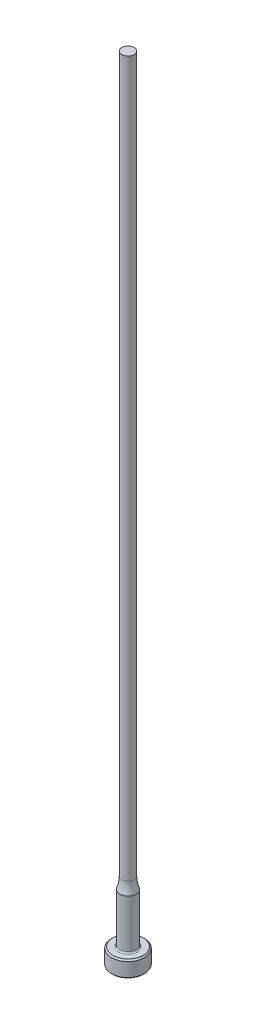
from build123d import *

# Parameters (mm, degrees)
CHAMFER1_SIZE = 0.254
FILLET1_R     = 0.254


with BuildPart() as part:
    # Sketch1 → Revolve1 (revolve)
    with BuildSketch(Plane.XY, mode=Mode.PRIVATE) as revolve1_sk:
        with BuildLine():
            Line((0, 0), (-3.175, 0))
            Line((-3.175, 0), (-3.175, 3.175))
            Line((-3.175, 3.175), (-1.5875, 3.175))
            Line((-1.5875, 3.175), (-1.5875, 12.7))
            ThreePointArc((-1.5875, 12.7), (-1.290157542, 13.787986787), (-1.18999, 14.911416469))
            Line((-1.18999, 14.911416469), (-1.18999, 152.4))
            Line((-1.18999, 152.4), (0, 152.4))
            Line((0, 152.4), (0, 0))
        make_face()
    revolve(revolve1_sk.sketch.rotate(Axis((0, 259.958771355, 0), (0, -1, 0)), 270), axis=Axis((0, 259.958771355, 0), (0, -1, 0)))

    # Chamfer1
    chamfer1_edges = [part.edges().sort_by_distance(p)[0] for p in [
        (0, 0, -3.175),
        (0, 3.175, -3.175),
    ]]
    chamfer(chamfer1_edges, length=CHAMFER1_SIZE)

    # Fillet1
    fillet1_edges = [part.edges().sort_by_distance(p)[0] for p in [
        (0, 3.175, -1.5875),
    ]]
    fillet(fillet1_edges, radius=FILLET1_R)


solid = part.part
